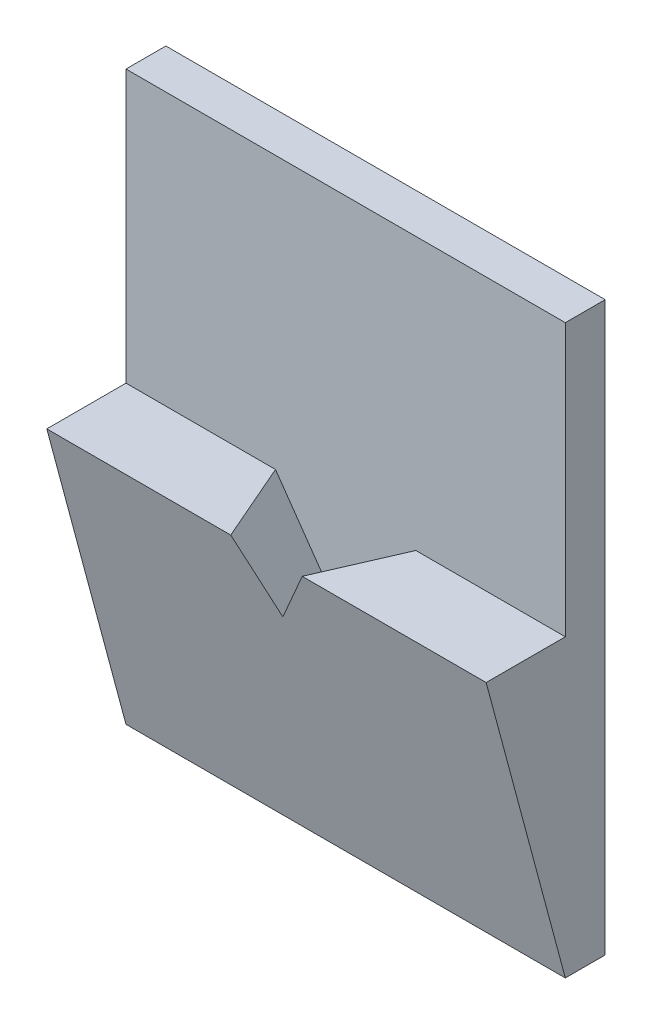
ISO-10303-21;
HEADER;
FILE_DESCRIPTION(('STEP AP214'),'2;1');
FILE_NAME('part.step','',(''),(''),'','','');
FILE_SCHEMA(('AUTOMOTIVE_DESIGN { 1 0 10303 214 1 1 1 1 }'));
ENDSEC;
DATA;
#1=APPLICATION_CONTEXT('core data for automotive mechanical design processes');
#2=APPLICATION_PROTOCOL_DEFINITION('international standard','automotive_design',2000,#1);
#3=PRODUCT_CONTEXT('',#1,'mechanical');
#4=PRODUCT('Part','Part','',(#3));
#5=PRODUCT_RELATED_PRODUCT_CATEGORY('part','',(#4));
#6=PRODUCT_DEFINITION_FORMATION('','',#4);
#7=PRODUCT_DEFINITION_CONTEXT('part definition',#1,'design');
#8=PRODUCT_DEFINITION('design','',#6,#7);
#9=PRODUCT_DEFINITION_SHAPE('','',#8);
#10=(LENGTH_UNIT() NAMED_UNIT(*) SI_UNIT(.MILLI.,.METRE.));
#11=(NAMED_UNIT(*) PLANE_ANGLE_UNIT() SI_UNIT($,.RADIAN.));
#12=(NAMED_UNIT(*) SI_UNIT($,.STERADIAN.) SOLID_ANGLE_UNIT());
#13=UNCERTAINTY_MEASURE_WITH_UNIT(LENGTH_MEASURE(1.E-05),#10,'distance_accuracy_value','');
#14=(GEOMETRIC_REPRESENTATION_CONTEXT(3) GLOBAL_UNCERTAINTY_ASSIGNED_CONTEXT((#13)) GLOBAL_UNIT_ASSIGNED_CONTEXT((#10,
#11,#12)) REPRESENTATION_CONTEXT('',''));
#15=CARTESIAN_POINT('',(0.,0.,0.));
#16=DIRECTION('',(0.,0.,1.));
#17=DIRECTION('',(1.,0.,0.));
#18=AXIS2_PLACEMENT_3D('',#15,#16,#17);
#19=CARTESIAN_POINT('',(3.76938179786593,-32.6335810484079,5.08));
#20=DIRECTION('',(-0.771631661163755,-0.540302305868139,0.335645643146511));
#21=DIRECTION('',(0.573576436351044,-0.819152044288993,0.));
#22=AXIS2_PLACEMENT_3D('',#19,#20,#21);
#23=PLANE('',#22);
#24=DIRECTION('',(0.491099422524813,-0.84142139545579,-0.225458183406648));
#25=VECTOR('',#24,1.);
#26=CARTESIAN_POINT('',(11.7455994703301,-37.7770124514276,15.137315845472));
#27=LINE('',#26,#25);
#28=CARTESIAN_POINT('',(-1.19541946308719,-15.6046177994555,21.0783910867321));
#29=VERTEX_POINT('',#28);
#30=CARTESIAN_POINT('',(-10.3031255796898,0.,25.2596358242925));
#31=VERTEX_POINT('',#30);
#32=EDGE_CURVE('E177',#29,#31,#27,.F.);
#33=ORIENTED_EDGE('',*,*,#32,.F.);
#34=DIRECTION('',(0.,-0.527686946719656,-0.84943892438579));
#35=VECTOR('',#34,1.);
#36=CARTESIAN_POINT('',(-1.19541946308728,-42.1666766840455,-21.6796245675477));
#37=LINE('',#36,#35);
#38=CARTESIAN_POINT('',(-1.19541946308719,-18.2881181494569,16.7586525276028));
#39=VERTEX_POINT('',#38);
#40=EDGE_CURVE('E11',#29,#39,#37,.T.);
#41=ORIENTED_EDGE('',*,*,#40,.T.);
#42=DIRECTION('',(-0.398879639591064,0.,-0.917003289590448));
#43=VECTOR('',#42,1.);
#44=CARTESIAN_POINT('',(-14.3747338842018,-18.2881181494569,-13.5398974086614));
#45=LINE('',#44,#43);
#46=CARTESIAN_POINT('',(-6.27541946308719,-18.2881181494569,5.08));
#47=VERTEX_POINT('',#46);
#48=EDGE_CURVE('E194',#39,#47,#45,.T.);
#49=ORIENTED_EDGE('',*,*,#48,.T.);
#50=DIRECTION('',(-0.573576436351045,0.819152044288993,0.));
#51=VECTOR('',#50,1.);
#52=CARTESIAN_POINT('',(3.76938179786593,-32.6335810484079,5.08));
#53=LINE('',#52,#51);
#54=CARTESIAN_POINT('',(-19.0808976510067,0.,5.08));
#55=VERTEX_POINT('',#54);
#56=EDGE_CURVE('E169',#47,#55,#53,.T.);
#57=ORIENTED_EDGE('',*,*,#56,.T.);
#58=DIRECTION('',(-0.398879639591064,0.,-0.917003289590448));
#59=VECTOR('',#58,1.);
#60=CARTESIAN_POINT('',(-25.142796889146,0.,-8.85598717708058));
#61=LINE('',#60,#59);
#62=EDGE_CURVE('E191',#31,#55,#61,.T.);
#63=ORIENTED_EDGE('',*,*,#62,.F.);
#64=EDGE_LOOP('',(#33,#41,#49,#57,#63));
#65=FACE_BOUND('',#64,.T.);
#66=ADVANCED_FACE('F37',(#65),#23,.F.);
#67=CARTESIAN_POINT('',(-42.9975376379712,-85.2427217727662,5.08));
#68=DIRECTION('',(0.771631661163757,-0.540302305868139,0.335645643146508));
#69=DIRECTION('',(0.573576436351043,0.819152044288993,0.));
#70=AXIS2_PLACEMENT_3D('',#67,#68,#69);
#71=PLANE('',#70);
#72=ORIENTED_EDGE('',*,*,#40,.F.);
#73=DIRECTION('',(0.491099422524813,0.84142139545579,0.225458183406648));
#74=VECTOR('',#73,1.);
#75=CARTESIAN_POINT('',(-41.1414416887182,-84.0458258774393,2.73962465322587));
#76=LINE('',#75,#74);
#77=CARTESIAN_POINT('',(7.91228665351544,0.,25.2596358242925));
#78=VERTEX_POINT('',#77);
#79=EDGE_CURVE('E181',#78,#29,#76,.F.);
#80=ORIENTED_EDGE('',*,*,#79,.F.);
#81=DIRECTION('',(-0.39887963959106,0.,0.91700328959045));
#82=VECTOR('',#81,1.);
#83=CARTESIAN_POINT('',(4.93682265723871,0.,32.1000708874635));
#84=LINE('',#83,#82);
#85=CARTESIAN_POINT('',(16.6900587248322,0.,5.08));
#86=VERTEX_POINT('',#85);
#87=EDGE_CURVE('E198',#86,#78,#84,.T.);
#88=ORIENTED_EDGE('',*,*,#87,.F.);
#89=DIRECTION('',(-0.573576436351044,-0.819152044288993,0.));
#90=VECTOR('',#89,1.);
#91=CARTESIAN_POINT('',(-42.9975376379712,-85.2427217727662,5.08));
#92=LINE('',#91,#90);
#93=CARTESIAN_POINT('',(3.88458053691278,-18.2881181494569,5.08));
#94=VERTEX_POINT('',#93);
#95=EDGE_CURVE('E162',#86,#94,#92,.T.);
#96=ORIENTED_EDGE('',*,*,#95,.T.);
#97=DIRECTION('',(0.39887963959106,0.,-0.91700328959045));
#98=VECTOR('',#97,1.);
#99=CARTESIAN_POINT('',(-3.5745973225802,-18.2881181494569,22.2282571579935));
#100=LINE('',#99,#98);
#101=EDGE_CURVE('E196',#39,#94,#100,.T.);
#102=ORIENTED_EDGE('',*,*,#101,.F.);
#103=EDGE_LOOP('',(#72,#80,#88,#96,#102));
#104=FACE_BOUND('',#103,.T.);
#105=ADVANCED_FACE('F228',(#104),#71,.F.);
#106=CARTESIAN_POINT('',(-57.1808976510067,0.,5.08));
#107=DIRECTION('',(0.,-1.,0.));
#108=DIRECTION('',(0.,0.,-1.));
#109=AXIS2_PLACEMENT_3D('',#106,#107,#108);
#110=PLANE('',#109);
#111=DIRECTION('',(-1.,0.,0.));
#112=VECTOR('',#111,1.);
#113=CARTESIAN_POINT('',(-57.1808976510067,0.,5.08));
#114=LINE('',#113,#112);
#115=CARTESIAN_POINT('',(-57.1808976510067,0.,5.08));
#116=VERTEX_POINT('',#115);
#117=EDGE_CURVE('E172',#55,#116,#114,.T.);
#118=ORIENTED_EDGE('',*,*,#117,.T.);
#119=DIRECTION('',(0.,0.,-1.));
#120=VECTOR('',#119,1.);
#121=CARTESIAN_POINT('',(-57.1808976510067,0.,5.08));
#122=LINE('',#121,#120);
#123=CARTESIAN_POINT('',(-57.1808976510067,0.,25.2596358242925));
#124=VERTEX_POINT('',#123);
#125=EDGE_CURVE('E185',#116,#124,#122,.F.);
#126=ORIENTED_EDGE('',*,*,#125,.T.);
#127=DIRECTION('',(1.,0.,0.));
#128=VECTOR('',#127,1.);
#129=CARTESIAN_POINT('',(-57.1808976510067,0.,25.2596358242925));
#130=LINE('',#129,#128);
#131=EDGE_CURVE('E180',#31,#124,#130,.F.);
#132=ORIENTED_EDGE('',*,*,#131,.F.);
#133=ORIENTED_EDGE('',*,*,#62,.T.);
#134=EDGE_LOOP('',(#118,#126,#132,#133));
#135=FACE_BOUND('',#134,.T.);
#136=ADVANCED_FACE('F39',(#135),#110,.F.);
#137=CARTESIAN_POINT('',(-57.1808976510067,-18.2881181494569,5.08));
#138=DIRECTION('',(0.,-1.,0.));
#139=DIRECTION('',(0.,0.,-1.));
#140=AXIS2_PLACEMENT_3D('',#137,#138,#139);
#141=PLANE('',#140);
#142=DIRECTION('',(-1.,0.,0.));
#143=VECTOR('',#142,1.);
#144=CARTESIAN_POINT('',(-57.1808976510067,-18.2881181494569,5.08));
#145=LINE('',#144,#143);
#146=EDGE_CURVE('E166',#94,#47,#145,.T.);
#147=ORIENTED_EDGE('',*,*,#146,.T.);
#148=ORIENTED_EDGE('',*,*,#48,.F.);
#149=ORIENTED_EDGE('',*,*,#101,.T.);
#150=EDGE_LOOP('',(#147,#148,#149));
#151=FACE_BOUND('',#150,.T.);
#152=ADVANCED_FACE('F227',(#151),#141,.F.);
#153=CARTESIAN_POINT('',(-57.1808976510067,0.,5.08));
#154=DIRECTION('',(0.,-1.,0.));
#155=DIRECTION('',(0.,0.,-1.));
#156=AXIS2_PLACEMENT_3D('',#153,#154,#155);
#157=PLANE('',#156);
#158=DIRECTION('',(-1.,0.,0.));
#159=VECTOR('',#158,1.);
#160=CARTESIAN_POINT('',(-57.1808976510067,0.,5.08));
#161=LINE('',#160,#159);
#162=CARTESIAN_POINT('',(54.7900587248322,0.,5.08));
#163=VERTEX_POINT('',#162);
#164=EDGE_CURVE('E121',#163,#86,#161,.T.);
#165=ORIENTED_EDGE('',*,*,#164,.T.);
#166=ORIENTED_EDGE('',*,*,#87,.T.);
#167=DIRECTION('',(1.,0.,0.));
#168=VECTOR('',#167,1.);
#169=CARTESIAN_POINT('',(-57.1808976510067,0.,25.2596358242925));
#170=LINE('',#169,#168);
#171=CARTESIAN_POINT('',(54.7900587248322,0.,25.2596358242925));
#172=VERTEX_POINT('',#171);
#173=EDGE_CURVE('E176',#172,#78,#170,.F.);
#174=ORIENTED_EDGE('',*,*,#173,.F.);
#175=DIRECTION('',(0.,0.,-1.));
#176=VECTOR('',#175,1.);
#177=CARTESIAN_POINT('',(54.7900587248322,0.,5.08));
#178=LINE('',#177,#176);
#179=EDGE_CURVE('E45',#163,#172,#178,.F.);
#180=ORIENTED_EDGE('',*,*,#179,.F.);
#181=EDGE_LOOP('',(#165,#166,#174,#180));
#182=FACE_BOUND('',#181,.T.);
#183=ADVANCED_FACE('F207',(#182),#157,.F.);
#184=CARTESIAN_POINT('',(-57.1808976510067,-75.3114261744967,5.08));
#185=DIRECTION('',(0.,-0.258819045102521,0.965925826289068));
#186=DIRECTION('',(0.,-0.965925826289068,-0.258819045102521));
#187=AXIS2_PLACEMENT_3D('',#184,#185,#186);
#188=PLANE('',#187);
#189=ORIENTED_EDGE('',*,*,#79,.T.);
#190=ORIENTED_EDGE('',*,*,#32,.T.);
#191=ORIENTED_EDGE('',*,*,#131,.T.);
#192=DIRECTION('',(0.,-0.965925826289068,-0.258819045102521));
#193=VECTOR('',#192,1.);
#194=CARTESIAN_POINT('',(-57.1808976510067,59.6449005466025,41.2414387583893));
#195=LINE('',#194,#193);
#196=CARTESIAN_POINT('',(-57.1808976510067,-75.3114261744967,5.08));
#197=VERTEX_POINT('',#196);
#198=EDGE_CURVE('E154',#124,#197,#195,.T.);
#199=ORIENTED_EDGE('',*,*,#198,.T.);
#200=DIRECTION('',(1.,0.,0.));
#201=VECTOR('',#200,1.);
#202=CARTESIAN_POINT('',(-57.1808976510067,-75.3114261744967,5.08));
#203=LINE('',#202,#201);
#204=CARTESIAN_POINT('',(54.7900587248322,-75.3114261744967,5.08));
#205=VERTEX_POINT('',#204);
#206=EDGE_CURVE('E125',#197,#205,#203,.T.);
#207=ORIENTED_EDGE('',*,*,#206,.T.);
#208=DIRECTION('',(0.,0.965925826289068,0.258819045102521));
#209=VECTOR('',#208,1.);
#210=CARTESIAN_POINT('',(54.7900587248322,59.6449005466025,41.2414387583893));
#211=LINE('',#210,#209);
#212=EDGE_CURVE('E124',#205,#172,#211,.T.);
#213=ORIENTED_EDGE('',*,*,#212,.T.);
#214=ORIENTED_EDGE('',*,*,#173,.T.);
#215=EDGE_LOOP('',(#189,#190,#191,#199,#207,#213,#214));
#216=FACE_BOUND('',#215,.T.);
#217=ADVANCED_FACE('F209',(#216),#188,.T.);
#218=CARTESIAN_POINT('',(-57.1808976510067,69.3343288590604,5.08));
#219=DIRECTION('',(1.,0.,0.));
#220=DIRECTION('',(0.,0.,-1.));
#221=AXIS2_PLACEMENT_3D('',#218,#219,#220);
#222=PLANE('',#221);
#223=DIRECTION('',(0.,-1.,0.));
#224=VECTOR('',#223,1.);
#225=CARTESIAN_POINT('',(-57.1808976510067,69.3343288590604,-5.08));
#226=LINE('',#225,#224);
#227=CARTESIAN_POINT('',(-57.1808976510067,69.3343288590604,-5.08));
#228=VERTEX_POINT('',#227);
#229=CARTESIAN_POINT('',(-57.1808976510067,-75.3114261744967,-5.08));
#230=VERTEX_POINT('',#229);
#231=EDGE_CURVE('E147',#228,#230,#226,.T.);
#232=ORIENTED_EDGE('',*,*,#231,.T.);
#233=DIRECTION('',(0.,0.,-1.));
#234=VECTOR('',#233,1.);
#235=CARTESIAN_POINT('',(-57.1808976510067,-75.3114261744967,5.08));
#236=LINE('',#235,#234);
#237=EDGE_CURVE('E157',#197,#230,#236,.T.);
#238=ORIENTED_EDGE('',*,*,#237,.F.);
#239=ORIENTED_EDGE('',*,*,#198,.F.);
#240=ORIENTED_EDGE('',*,*,#125,.F.);
#241=DIRECTION('',(0.,-1.,0.));
#242=VECTOR('',#241,1.);
#243=CARTESIAN_POINT('',(-57.1808976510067,69.3343288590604,5.08));
#244=LINE('',#243,#242);
#245=CARTESIAN_POINT('',(-57.1808976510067,69.3343288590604,5.08));
#246=VERTEX_POINT('',#245);
#247=EDGE_CURVE('E201',#246,#116,#244,.T.);
#248=ORIENTED_EDGE('',*,*,#247,.F.);
#249=DIRECTION('',(0.,0.,-1.));
#250=VECTOR('',#249,1.);
#251=CARTESIAN_POINT('',(-57.1808976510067,69.3343288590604,5.08));
#252=LINE('',#251,#250);
#253=EDGE_CURVE('E136',#246,#228,#252,.T.);
#254=ORIENTED_EDGE('',*,*,#253,.T.);
#255=EDGE_LOOP('',(#232,#238,#239,#240,#248,#254));
#256=FACE_BOUND('',#255,.T.);
#257=ADVANCED_FACE('F219',(#256),#222,.F.);
#258=CARTESIAN_POINT('',(-57.1808976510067,-75.3114261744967,5.08));
#259=DIRECTION('',(0.,1.,0.));
#260=DIRECTION('',(0.,0.,1.));
#261=AXIS2_PLACEMENT_3D('',#258,#259,#260);
#262=PLANE('',#261);
#263=DIRECTION('',(1.,0.,0.));
#264=VECTOR('',#263,1.);
#265=CARTESIAN_POINT('',(-57.1808976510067,-75.3114261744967,-5.08));
#266=LINE('',#265,#264);
#267=CARTESIAN_POINT('',(54.7900587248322,-75.3114261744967,-5.08));
#268=VERTEX_POINT('',#267);
#269=EDGE_CURVE('E150',#230,#268,#266,.T.);
#270=ORIENTED_EDGE('',*,*,#269,.T.);
#271=DIRECTION('',(0.,0.,-1.));
#272=VECTOR('',#271,1.);
#273=CARTESIAN_POINT('',(54.7900587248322,-75.3114261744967,5.08));
#274=LINE('',#273,#272);
#275=EDGE_CURVE('E135',#205,#268,#274,.T.);
#276=ORIENTED_EDGE('',*,*,#275,.F.);
#277=ORIENTED_EDGE('',*,*,#206,.F.);
#278=ORIENTED_EDGE('',*,*,#237,.T.);
#279=EDGE_LOOP('',(#270,#276,#277,#278));
#280=FACE_BOUND('',#279,.T.);
#281=ADVANCED_FACE('F214',(#280),#262,.F.);
#282=CARTESIAN_POINT('',(54.7900587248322,69.3343288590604,5.08));
#283=DIRECTION('',(-1.,0.,0.));
#284=DIRECTION('',(0.,0.,1.));
#285=AXIS2_PLACEMENT_3D('',#282,#283,#284);
#286=PLANE('',#285);
#287=DIRECTION('',(0.,1.,0.));
#288=VECTOR('',#287,1.);
#289=CARTESIAN_POINT('',(54.7900587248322,69.3343288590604,-5.08));
#290=LINE('',#289,#288);
#291=CARTESIAN_POINT('',(54.7900587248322,69.3343288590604,-5.08));
#292=VERTEX_POINT('',#291);
#293=EDGE_CURVE('E132',#268,#292,#290,.T.);
#294=ORIENTED_EDGE('',*,*,#293,.T.);
#295=DIRECTION('',(0.,0.,-1.));
#296=VECTOR('',#295,1.);
#297=CARTESIAN_POINT('',(54.7900587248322,69.3343288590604,5.08));
#298=LINE('',#297,#296);
#299=CARTESIAN_POINT('',(54.7900587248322,69.3343288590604,5.08));
#300=VERTEX_POINT('',#299);
#301=EDGE_CURVE('E128',#300,#292,#298,.T.);
#302=ORIENTED_EDGE('',*,*,#301,.F.);
#303=DIRECTION('',(0.,1.,0.));
#304=VECTOR('',#303,1.);
#305=CARTESIAN_POINT('',(54.7900587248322,69.3343288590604,5.08));
#306=LINE('',#305,#304);
#307=EDGE_CURVE('E111',#163,#300,#306,.T.);
#308=ORIENTED_EDGE('',*,*,#307,.F.);
#309=ORIENTED_EDGE('',*,*,#179,.T.);
#310=ORIENTED_EDGE('',*,*,#212,.F.);
#311=ORIENTED_EDGE('',*,*,#275,.T.);
#312=EDGE_LOOP('',(#294,#302,#308,#309,#310,#311));
#313=FACE_BOUND('',#312,.T.);
#314=ADVANCED_FACE('F129',(#313),#286,.F.);
#315=CARTESIAN_POINT('',(-57.1808976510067,69.3343288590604,5.08));
#316=DIRECTION('',(0.,-1.,0.));
#317=DIRECTION('',(0.,0.,-1.));
#318=AXIS2_PLACEMENT_3D('',#315,#316,#317);
#319=PLANE('',#318);
#320=DIRECTION('',(-1.,0.,0.));
#321=VECTOR('',#320,1.);
#322=CARTESIAN_POINT('',(-57.1808976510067,69.3343288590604,-5.08));
#323=LINE('',#322,#321);
#324=EDGE_CURVE('E153',#292,#228,#323,.T.);
#325=ORIENTED_EDGE('',*,*,#324,.T.);
#326=ORIENTED_EDGE('',*,*,#253,.F.);
#327=DIRECTION('',(-1.,0.,0.));
#328=VECTOR('',#327,1.);
#329=CARTESIAN_POINT('',(-57.1808976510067,69.3343288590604,5.08));
#330=LINE('',#329,#328);
#331=EDGE_CURVE('E117',#300,#246,#330,.T.);
#332=ORIENTED_EDGE('',*,*,#331,.F.);
#333=ORIENTED_EDGE('',*,*,#301,.T.);
#334=EDGE_LOOP('',(#325,#326,#332,#333));
#335=FACE_BOUND('',#334,.T.);
#336=ADVANCED_FACE('F138',(#335),#319,.F.);
#337=CARTESIAN_POINT('',(-57.1808976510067,-75.3114261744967,5.08));
#338=DIRECTION('',(0.,0.,1.));
#339=DIRECTION('',(1.,0.,0.));
#340=AXIS2_PLACEMENT_3D('',#337,#338,#339);
#341=PLANE('',#340);
#342=ORIENTED_EDGE('',*,*,#117,.F.);
#343=ORIENTED_EDGE('',*,*,#56,.F.);
#344=ORIENTED_EDGE('',*,*,#146,.F.);
#345=ORIENTED_EDGE('',*,*,#95,.F.);
#346=ORIENTED_EDGE('',*,*,#164,.F.);
#347=ORIENTED_EDGE('',*,*,#307,.T.);
#348=ORIENTED_EDGE('',*,*,#331,.T.);
#349=ORIENTED_EDGE('',*,*,#247,.T.);
#350=EDGE_LOOP('',(#342,#343,#344,#345,#346,#347,#348,#349));
#351=FACE_BOUND('',#350,.T.);
#352=ADVANCED_FACE('F114',(#351),#341,.T.);
#353=CARTESIAN_POINT('',(-57.1808976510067,-75.3114261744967,-5.08));
#354=DIRECTION('',(0.,0.,1.));
#355=DIRECTION('',(1.,0.,0.));
#356=AXIS2_PLACEMENT_3D('',#353,#354,#355);
#357=PLANE('',#356);
#358=ORIENTED_EDGE('',*,*,#231,.F.);
#359=ORIENTED_EDGE('',*,*,#324,.F.);
#360=ORIENTED_EDGE('',*,*,#293,.F.);
#361=ORIENTED_EDGE('',*,*,#269,.F.);
#362=EDGE_LOOP('',(#358,#359,#360,#361));
#363=FACE_BOUND('',#362,.T.);
#364=ADVANCED_FACE('F217',(#363),#357,.F.);
#365=CLOSED_SHELL('',(#66,#105,#136,#152,#183,#217,#257,#281,#314,#336,#352,#364));
#366=MANIFOLD_SOLID_BREP('B2',#365);
#367=ADVANCED_BREP_SHAPE_REPRESENTATION('',(#18,#366),#14);
#368=SHAPE_DEFINITION_REPRESENTATION(#9,#367);
ENDSEC;
END-ISO-10303-21;
